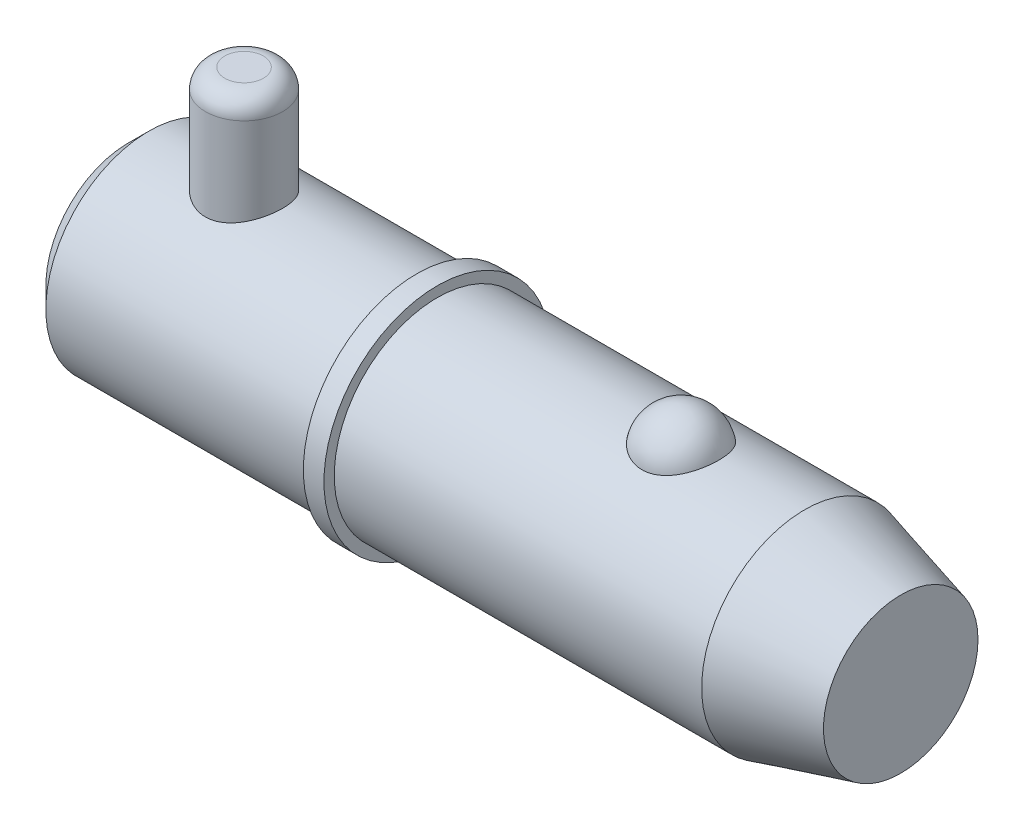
ISO-10303-21;
HEADER;
FILE_DESCRIPTION(('STEP AP214'),'2;1');
FILE_NAME('part.step','',(''),(''),'','','');
FILE_SCHEMA(('AUTOMOTIVE_DESIGN { 1 0 10303 214 1 1 1 1 }'));
ENDSEC;
DATA;
#1=APPLICATION_CONTEXT('core data for automotive mechanical design processes');
#2=APPLICATION_PROTOCOL_DEFINITION('international standard','automotive_design',2000,#1);
#3=PRODUCT_CONTEXT('',#1,'mechanical');
#4=PRODUCT('Part','Part','',(#3));
#5=PRODUCT_RELATED_PRODUCT_CATEGORY('part','',(#4));
#6=PRODUCT_DEFINITION_FORMATION('','',#4);
#7=PRODUCT_DEFINITION_CONTEXT('part definition',#1,'design');
#8=PRODUCT_DEFINITION('design','',#6,#7);
#9=PRODUCT_DEFINITION_SHAPE('','',#8);
#10=(LENGTH_UNIT() NAMED_UNIT(*) SI_UNIT(.MILLI.,.METRE.));
#11=(NAMED_UNIT(*) PLANE_ANGLE_UNIT() SI_UNIT($,.RADIAN.));
#12=(NAMED_UNIT(*) SI_UNIT($,.STERADIAN.) SOLID_ANGLE_UNIT());
#13=UNCERTAINTY_MEASURE_WITH_UNIT(LENGTH_MEASURE(1.E-05),#10,'distance_accuracy_value','');
#14=(GEOMETRIC_REPRESENTATION_CONTEXT(3) GLOBAL_UNCERTAINTY_ASSIGNED_CONTEXT((#13)) GLOBAL_UNIT_ASSIGNED_CONTEXT((#10,
#11,#12)) REPRESENTATION_CONTEXT('',''));
#15=CARTESIAN_POINT('',(0.,0.,0.));
#16=DIRECTION('',(0.,0.,1.));
#17=DIRECTION('',(1.,0.,0.));
#18=AXIS2_PLACEMENT_3D('',#15,#16,#17);
#19=CARTESIAN_POINT('',(14.28,25.4,0.));
#20=DIRECTION('',(0.,-1.,0.));
#21=DIRECTION('',(0.,0.,-1.));
#22=AXIS2_PLACEMENT_3D('',#19,#20,#21);
#23=CYLINDRICAL_SURFACE('',#22,4.76);
#24=CARTESIAN_POINT('',(14.28,-10.32,0.));
#25=DIRECTION('',(0.,1.,0.));
#26=DIRECTION('',(0.,0.,1.));
#27=AXIS2_PLACEMENT_3D('',#24,#25,#26);
#28=CIRCLE('',#27,4.76);
#29=CARTESIAN_POINT('',(14.28,-10.32,-4.76));
#30=VERTEX_POINT('',#29);
#31=EDGE_CURVE('P0_E25',#30,#30,#28,.T.);
#32=CARTESIAN_POINT('',(14.28,23.02,0.));
#33=DIRECTION('',(0.,1.,0.));
#34=DIRECTION('',(0.,0.,1.));
#35=AXIS2_PLACEMENT_3D('',#32,#33,#34);
#36=CIRCLE('',#35,4.76);
#37=CARTESIAN_POINT('',(14.28,23.02,-4.76));
#38=VERTEX_POINT('',#37);
#39=EDGE_CURVE('P0_E29',#38,#38,#36,.F.);
#40=CARTESIAN_POINT('',(14.28,-10.32,-4.76));
#41=CARTESIAN_POINT('',(14.28,-9.97270833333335,-4.76));
#42=CARTESIAN_POINT('',(14.28,-9.62541666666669,-4.76));
#43=CARTESIAN_POINT('',(14.28,-8.93083333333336,-4.76));
#44=CARTESIAN_POINT('',(14.28,-8.58354166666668,-4.76));
#45=CARTESIAN_POINT('',(14.28,-7.88895833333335,-4.76));
#46=CARTESIAN_POINT('',(14.28,-7.54166666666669,-4.76));
#47=CARTESIAN_POINT('',(14.28,-6.84708333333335,-4.76));
#48=CARTESIAN_POINT('',(14.28,-6.49979166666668,-4.76));
#49=CARTESIAN_POINT('',(14.28,-5.80520833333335,-4.76));
#50=CARTESIAN_POINT('',(14.28,-5.45791666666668,-4.76));
#51=CARTESIAN_POINT('',(14.28,-4.76333333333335,-4.76));
#52=CARTESIAN_POINT('',(14.28,-4.41604166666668,-4.76));
#53=CARTESIAN_POINT('',(14.28,-3.72145833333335,-4.76));
#54=CARTESIAN_POINT('',(14.28,-3.37416666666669,-4.76));
#55=CARTESIAN_POINT('',(14.28,-2.67958333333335,-4.76));
#56=CARTESIAN_POINT('',(14.28,-2.33229166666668,-4.76));
#57=CARTESIAN_POINT('',(14.28,-1.63770833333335,-4.76));
#58=CARTESIAN_POINT('',(14.28,-1.29041666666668,-4.76));
#59=CARTESIAN_POINT('',(14.28,-0.595833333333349,-4.76));
#60=CARTESIAN_POINT('',(14.28,-0.24854166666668,-4.76));
#61=CARTESIAN_POINT('',(14.28,0.446041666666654,-4.76));
#62=CARTESIAN_POINT('',(14.28,0.793333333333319,-4.76));
#63=CARTESIAN_POINT('',(14.28,1.48791666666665,-4.76));
#64=CARTESIAN_POINT('',(14.28,1.83520833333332,-4.76));
#65=CARTESIAN_POINT('',(14.28,2.52979166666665,-4.76));
#66=CARTESIAN_POINT('',(14.28,2.87708333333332,-4.76));
#67=CARTESIAN_POINT('',(14.28,3.57166666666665,-4.76));
#68=CARTESIAN_POINT('',(14.28,3.91895833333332,-4.76));
#69=CARTESIAN_POINT('',(14.28,4.61354166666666,-4.76));
#70=CARTESIAN_POINT('',(14.28,4.96083333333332,-4.76));
#71=CARTESIAN_POINT('',(14.28,5.65541666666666,-4.76));
#72=CARTESIAN_POINT('',(14.28,6.00270833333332,-4.76));
#73=CARTESIAN_POINT('',(14.28,6.69729166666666,-4.76));
#74=CARTESIAN_POINT('',(14.28,7.04458333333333,-4.76));
#75=CARTESIAN_POINT('',(14.28,7.73916666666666,-4.76));
#76=CARTESIAN_POINT('',(14.28,8.08645833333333,-4.76));
#77=CARTESIAN_POINT('',(14.28,8.78104166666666,-4.76));
#78=CARTESIAN_POINT('',(14.28,9.12833333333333,-4.76));
#79=CARTESIAN_POINT('',(14.28,9.82291666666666,-4.76));
#80=CARTESIAN_POINT('',(14.28,10.1702083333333,-4.76));
#81=CARTESIAN_POINT('',(14.28,10.8647916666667,-4.76));
#82=CARTESIAN_POINT('',(14.28,11.2120833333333,-4.76));
#83=CARTESIAN_POINT('',(14.28,11.9066666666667,-4.76));
#84=CARTESIAN_POINT('',(14.28,12.2539583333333,-4.76));
#85=CARTESIAN_POINT('',(14.28,12.9485416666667,-4.76));
#86=CARTESIAN_POINT('',(14.28,13.2958333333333,-4.76));
#87=CARTESIAN_POINT('',(14.28,13.9904166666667,-4.76));
#88=CARTESIAN_POINT('',(14.28,14.3377083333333,-4.76));
#89=CARTESIAN_POINT('',(14.28,15.0322916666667,-4.76));
#90=CARTESIAN_POINT('',(14.28,15.3795833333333,-4.76));
#91=CARTESIAN_POINT('',(14.28,16.0741666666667,-4.76));
#92=CARTESIAN_POINT('',(14.28,16.4214583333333,-4.76));
#93=CARTESIAN_POINT('',(14.28,17.1160416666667,-4.76));
#94=CARTESIAN_POINT('',(14.28,17.4633333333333,-4.76));
#95=CARTESIAN_POINT('',(14.28,18.1579166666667,-4.76));
#96=CARTESIAN_POINT('',(14.28,18.5052083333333,-4.76));
#97=CARTESIAN_POINT('',(14.28,19.1997916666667,-4.76));
#98=CARTESIAN_POINT('',(14.28,19.5470833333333,-4.76));
#99=CARTESIAN_POINT('',(14.28,20.2416666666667,-4.76));
#100=CARTESIAN_POINT('',(14.28,20.5889583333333,-4.76));
#101=CARTESIAN_POINT('',(14.28,21.2835416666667,-4.76));
#102=CARTESIAN_POINT('',(14.28,21.6308333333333,-4.76));
#103=CARTESIAN_POINT('',(14.28,22.3254166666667,-4.76));
#104=CARTESIAN_POINT('',(14.28,22.6727083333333,-4.76));
#105=CARTESIAN_POINT('',(14.28,23.02,-4.76));
#106=B_SPLINE_CURVE_WITH_KNOTS('',3,(#40,#41,#42,#43,#44,#45,#46,#47,#48,#49,#50,#51,#52,#53,
#54,#55,#56,#57,#58,#59,#60,#61,#62,#63,#64,#65,#66,#67,#68,#69,#70,#71,#72,#73,#74,#75,#76,#77,
#78,#79,#80,#81,#82,#83,#84,#85,#86,#87,#88,#89,#90,#91,#92,#93,#94,#95,#96,#97,#98,#99,#100,
#101,#102,#103,#104,#105),.UNSPECIFIED.,.F.,.F.,(4,2,2,2,2,2,2,2,2,2,2,2,2,2,2,2,2,2,2,2,2,2,2,
2,2,2,2,2,2,2,2,2,4),(0.,1.041875,2.08375,3.125625,4.1675,5.209375,6.25125,7.293125,
8.33500000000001,9.376875,10.41875,11.460625,12.5025,13.544375,14.58625,15.628125,16.67,
17.711875,18.75375,19.795625,20.8375,21.879375,22.92125,23.963125,25.005,26.046875,27.08875,
28.130625,29.1725,30.214375,31.25625,32.298125,33.34),.UNSPECIFIED.);
#107=EDGE_CURVE('P0_BSEAM14',#30,#38,#106,.T.);
#108=ORIENTED_EDGE('',*,*,#31,.T.);
#109=ORIENTED_EDGE('',*,*,#39,.T.);
#110=ORIENTED_EDGE('',*,*,#107,.T.);
#111=ORIENTED_EDGE('',*,*,#107,.F.);
#112=EDGE_LOOP('',(#108,#110,#109,#111));
#113=FACE_BOUND('',#112,.T.);
#114=ADVANCED_FACE('P0_F14',(#113),#23,.T.);
#115=CARTESIAN_POINT('',(14.28,25.4,0.));
#116=DIRECTION('',(0.,1.,0.));
#117=DIRECTION('',(0.,0.,1.));
#118=AXIS2_PLACEMENT_3D('',#115,#116,#117);
#119=PLANE('',#118);
#120=CARTESIAN_POINT('',(14.28,25.4,0.));
#121=DIRECTION('',(0.,1.,0.));
#122=DIRECTION('',(0.,0.,1.));
#123=AXIS2_PLACEMENT_3D('',#120,#121,#122);
#124=CIRCLE('',#123,2.38);
#125=CARTESIAN_POINT('',(14.28,25.4,2.38));
#126=VERTEX_POINT('',#125);
#127=EDGE_CURVE('P0_E10',#126,#126,#124,.T.);
#128=ORIENTED_EDGE('',*,*,#127,.T.);
#129=EDGE_LOOP('',(#128));
#130=FACE_BOUND('',#129,.T.);
#131=ADVANCED_FACE('P0_F46',(#130),#119,.T.);
#132=CARTESIAN_POINT('',(14.28,-12.7,0.));
#133=DIRECTION('',(0.,1.,0.));
#134=DIRECTION('',(0.,0.,1.));
#135=AXIS2_PLACEMENT_3D('',#132,#133,#134);
#136=PLANE('',#135);
#137=CARTESIAN_POINT('',(14.28,-12.7,0.));
#138=DIRECTION('',(0.,1.,0.));
#139=DIRECTION('',(0.,0.,1.));
#140=AXIS2_PLACEMENT_3D('',#137,#138,#139);
#141=CIRCLE('',#140,2.38);
#142=CARTESIAN_POINT('',(14.28,-12.7,2.38));
#143=VERTEX_POINT('',#142);
#144=EDGE_CURVE('P0_E21',#143,#143,#141,.F.);
#145=ORIENTED_EDGE('',*,*,#144,.T.);
#146=EDGE_LOOP('',(#145));
#147=FACE_BOUND('',#146,.T.);
#148=ADVANCED_FACE('P0_F43',(#147),#136,.F.);
#149=CARTESIAN_POINT('',(14.28,-10.32,0.));
#150=DIRECTION('',(0.,1.,0.));
#151=DIRECTION('',(0.,0.,1.));
#152=AXIS2_PLACEMENT_3D('',#149,#150,#151);
#153=DEGENERATE_TOROIDAL_SURFACE('',#152,2.38,2.38,.T.);
#154=ORIENTED_EDGE('',*,*,#144,.F.);
#155=EDGE_LOOP('',(#154));
#156=FACE_BOUND('',#155,.T.);
#157=ORIENTED_EDGE('',*,*,#31,.F.);
#158=EDGE_LOOP('',(#157));
#159=FACE_BOUND('',#158,.T.);
#160=ADVANCED_FACE('P0_F38',(#156,#159),#153,.T.);
#161=CARTESIAN_POINT('',(14.28,23.02,0.));
#162=DIRECTION('',(0.,1.,0.));
#163=DIRECTION('',(0.,0.,1.));
#164=AXIS2_PLACEMENT_3D('',#161,#162,#163);
#165=DEGENERATE_TOROIDAL_SURFACE('',#164,2.38,2.38,.T.);
#166=ORIENTED_EDGE('',*,*,#39,.F.);
#167=EDGE_LOOP('',(#166));
#168=FACE_BOUND('',#167,.T.);
#169=ORIENTED_EDGE('',*,*,#127,.F.);
#170=EDGE_LOOP('',(#169));
#171=FACE_BOUND('',#170,.T.);
#172=ADVANCED_FACE('P0_F16',(#168,#171),#165,.T.);
#173=CLOSED_SHELL('',(#114,#131,#148,#160,#172));
#174=MANIFOLD_SOLID_BREP('P0_B1',#173);
#175=CARTESIAN_POINT('',(0.,0.,0.));
#176=DIRECTION('',(1.,0.,0.));
#177=DIRECTION('',(0.,0.,-1.));
#178=AXIS2_PLACEMENT_3D('',#175,#176,#177);
#179=CYLINDRICAL_SURFACE('',#178,12.7);
#180=CARTESIAN_POINT('',(83.4007386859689,0.,0.));
#181=DIRECTION('',(1.,0.,0.));
#182=DIRECTION('',(0.,0.,-1.));
#183=AXIS2_PLACEMENT_3D('',#180,#181,#182);
#184=CIRCLE('',#183,12.7);
#185=CARTESIAN_POINT('',(83.4007386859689,0.,-12.7));
#186=VERTEX_POINT('',#185);
#187=EDGE_CURVE('P1_E81',#186,#186,#184,.T.);
#188=ORIENTED_EDGE('',*,*,#187,.F.);
#189=EDGE_LOOP('',(#188));
#190=FACE_BOUND('',#189,.T.);
#191=CARTESIAN_POINT('',(38.1,0.,0.));
#192=DIRECTION('',(1.,0.,0.));
#193=DIRECTION('',(0.,0.,-1.));
#194=AXIS2_PLACEMENT_3D('',#191,#192,#193);
#195=CIRCLE('',#194,12.7);
#196=CARTESIAN_POINT('',(38.1,0.,-12.7));
#197=VERTEX_POINT('',#196);
#198=EDGE_CURVE('P1_E85',#197,#197,#195,.T.);
#199=ORIENTED_EDGE('',*,*,#198,.T.);
#200=EDGE_LOOP('',(#199));
#201=FACE_BOUND('',#200,.T.);
#202=CARTESIAN_POINT('',(68.1600429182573,11.7500437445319,4.81938502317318));
#203=CARTESIAN_POINT('',(68.0350881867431,11.7500430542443,4.81938571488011));
#204=CARTESIAN_POINT('',(67.910144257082,11.7520975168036,4.81438658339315));
#205=CARTESIAN_POINT('',(67.6611425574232,11.760253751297,4.79442904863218));
#206=CARTESIAN_POINT('',(67.5370850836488,11.7663568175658,4.77946746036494));
#207=CARTESIAN_POINT('',(67.2909016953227,11.7824262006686,4.7397141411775));
#208=CARTESIAN_POINT('',(67.1687744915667,11.7923898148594,4.71492928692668));
#209=CARTESIAN_POINT('',(66.9271874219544,11.8158938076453,4.65571340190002));
#210=CARTESIAN_POINT('',(66.8077285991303,11.8294355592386,4.6212786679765));
#211=CARTESIAN_POINT('',(66.5725578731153,11.8596812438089,4.54309502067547));
#212=CARTESIAN_POINT('',(66.4568393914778,11.8763792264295,4.49936361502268));
#213=CARTESIAN_POINT('',(66.2296530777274,11.9124878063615,4.40287235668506));
#214=CARTESIAN_POINT('',(66.1181868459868,11.9318994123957,4.35010914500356));
#215=CARTESIAN_POINT('',(65.7912782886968,11.9934256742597,4.17881316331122));
#216=CARTESIAN_POINT('',(65.5831270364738,12.038858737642,4.04720756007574));
#217=CARTESIAN_POINT('',(65.1858509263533,12.1352173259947,3.748564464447));
#218=CARTESIAN_POINT('',(64.9974438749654,12.1862630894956,3.58061821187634));
#219=CARTESIAN_POINT('',(64.6505213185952,12.2875163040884,3.21600758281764));
#220=CARTESIAN_POINT('',(64.4920113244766,12.3377235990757,3.0193379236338));
#221=CARTESIAN_POINT('',(64.2016887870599,12.434492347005,2.592916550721));
#222=CARTESIAN_POINT('',(64.0713762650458,12.4807925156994,2.36208286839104));
#223=CARTESIAN_POINT('',(63.8494079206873,12.5623454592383,1.88070399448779));
#224=CARTESIAN_POINT('',(63.7577554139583,12.5975972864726,1.63015711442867));
#225=CARTESIAN_POINT('',(63.6140466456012,12.6538414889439,1.1129886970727));
#226=CARTESIAN_POINT('',(63.5624990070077,12.6746503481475,0.846205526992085));
#227=CARTESIAN_POINT('',(63.5019771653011,12.699153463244,0.307085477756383));
#228=CARTESIAN_POINT('',(63.4930018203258,12.7028481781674,0.0347487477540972));
#229=CARTESIAN_POINT('',(63.5177310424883,12.6927785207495,-0.506073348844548));
#230=CARTESIAN_POINT('',(63.5511899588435,12.6791146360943,-0.77457186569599));
#231=CARTESIAN_POINT('',(63.6596877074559,12.635882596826,-1.30170246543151));
#232=CARTESIAN_POINT('',(63.7347272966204,12.606314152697,-1.5603343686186));
#233=CARTESIAN_POINT('',(63.9250000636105,12.5342328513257,-2.06083899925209));
#234=CARTESIAN_POINT('',(64.0402872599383,12.4917026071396,-2.3026886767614));
#235=CARTESIAN_POINT('',(64.3087044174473,12.3981123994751,-2.76259600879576));
#236=CARTESIAN_POINT('',(64.4618374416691,12.3470517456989,-2.98065173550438));
#237=CARTESIAN_POINT('',(64.8035077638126,12.2416045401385,-3.38786328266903));
#238=CARTESIAN_POINT('',(64.9922017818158,12.1872040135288,-3.57688418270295));
#239=CARTESIAN_POINT('',(65.4002392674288,12.0814086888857,-3.91941073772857));
#240=CARTESIAN_POINT('',(65.6195800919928,12.0300136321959,-4.07291945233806));
#241=CARTESIAN_POINT('',(66.0783753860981,11.9373542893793,-4.33691289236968));
#242=CARTESIAN_POINT('',(66.3173044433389,11.8958982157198,-4.44824125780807));
#243=CARTESIAN_POINT('',(66.8124376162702,11.8268116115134,-4.62881985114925));
#244=CARTESIAN_POINT('',(67.0686351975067,11.7991758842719,-4.69808589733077));
#245=CARTESIAN_POINT('',(67.5771640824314,11.7622209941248,-4.78983181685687));
#246=CARTESIAN_POINT('',(67.8290414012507,11.7520502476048,-4.81449025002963));
#247=CARTESIAN_POINT('',(68.3335734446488,11.7485796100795,-4.82295735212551));
#248=CARTESIAN_POINT('',(68.5862280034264,11.7552763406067,-4.80677420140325));
#249=CARTESIAN_POINT('',(69.0768341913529,11.7842584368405,-4.73525430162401));
#250=CARTESIAN_POINT('',(69.3149984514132,11.8060486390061,-4.68116061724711));
#251=CARTESIAN_POINT('',(69.7784894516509,11.8622750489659,-4.53678133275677));
#252=CARTESIAN_POINT('',(70.0038151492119,11.8967122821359,-4.44649279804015));
#253=CARTESIAN_POINT('',(70.4408018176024,11.9754603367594,-4.2298761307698));
#254=CARTESIAN_POINT('',(70.6520579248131,12.0199699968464,-4.10280539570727));
#255=CARTESIAN_POINT('',(71.0506012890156,12.1138028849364,-3.81685409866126));
#256=CARTESIAN_POINT('',(71.2378830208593,12.163127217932,-3.65796622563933));
#257=CARTESIAN_POINT('',(71.5933509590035,12.2642343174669,-3.30364864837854));
#258=CARTESIAN_POINT('',(71.7601119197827,12.3160165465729,-3.10678783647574));
#259=CARTESIAN_POINT('',(72.0595799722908,12.4142566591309,-2.68748409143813));
#260=CARTESIAN_POINT('',(72.1922809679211,12.4607135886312,-2.46503658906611));
#261=CARTESIAN_POINT('',(72.4246912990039,12.5450236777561,-1.99289519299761));
#262=CARTESIAN_POINT('',(72.523215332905,12.5825557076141,-1.74255918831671));
#263=CARTESIAN_POINT('',(72.6792277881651,12.6431720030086,-1.22773734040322));
#264=CARTESIAN_POINT('',(72.7367157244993,12.6662560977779,-0.963251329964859));
#265=CARTESIAN_POINT('',(72.8095441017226,12.6956486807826,-0.427355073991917));
#266=CARTESIAN_POINT('',(72.8248378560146,12.7019385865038,-0.1559374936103));
#267=CARTESIAN_POINT('',(72.8127794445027,12.6970201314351,0.385928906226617));
#268=CARTESIAN_POINT('',(72.7854280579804,12.6858120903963,0.656377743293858));
#269=CARTESIAN_POINT('',(72.7130609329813,12.6568455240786,1.05454017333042));
#270=CARTESIAN_POINT('',(72.6837963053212,12.6451962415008,1.18577850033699));
#271=CARTESIAN_POINT('',(72.6150228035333,12.6181819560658,1.4451380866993));
#272=CARTESIAN_POINT('',(72.5755176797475,12.6028183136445,1.57326046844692));
#273=CARTESIAN_POINT('',(72.4864397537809,12.5687547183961,1.82554978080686));
#274=CARTESIAN_POINT('',(72.4368627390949,12.5500533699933,1.9497150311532));
#275=CARTESIAN_POINT('',(72.3279211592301,12.5098093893,2.1931437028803));
#276=CARTESIAN_POINT('',(72.2685601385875,12.4882677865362,2.31240887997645));
#277=CARTESIAN_POINT('',(72.1399712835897,12.4427679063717,2.54593031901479));
#278=CARTESIAN_POINT('',(72.0706888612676,12.4187964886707,2.66015396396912));
#279=CARTESIAN_POINT('',(71.922903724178,12.3691892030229,2.88202659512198));
#280=CARTESIAN_POINT('',(71.8444044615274,12.3435539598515,2.98967802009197));
#281=CARTESIAN_POINT('',(71.6785502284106,12.2912955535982,3.19774385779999));
#282=CARTESIAN_POINT('',(71.5911918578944,12.2646720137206,3.29815546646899));
#283=CARTESIAN_POINT('',(71.4081617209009,12.2111945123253,3.49095035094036));
#284=CARTESIAN_POINT('',(71.3124932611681,12.1843406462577,3.58333679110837));
#285=CARTESIAN_POINT('',(71.1136272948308,12.1312249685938,3.75922876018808));
#286=CARTESIAN_POINT('',(71.0104503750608,12.104961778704,3.84275713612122));
#287=CARTESIAN_POINT('',(70.7970133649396,12.0537284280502,4.00056406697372));
#288=CARTESIAN_POINT('',(70.6867562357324,12.028757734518,4.07484645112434));
#289=CARTESIAN_POINT('',(70.4597550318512,11.9808306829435,4.21367959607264));
#290=CARTESIAN_POINT('',(70.3430068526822,11.9578756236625,4.27822410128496));
#291=CARTESIAN_POINT('',(70.1039425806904,11.9147184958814,4.39698483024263));
#292=CARTESIAN_POINT('',(69.9816287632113,11.894515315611,4.45120522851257));
#293=CARTESIAN_POINT('',(69.722952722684,11.8561129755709,4.55255353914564));
#294=CARTESIAN_POINT('',(69.5862237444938,11.8381764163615,4.59884858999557));
#295=CARTESIAN_POINT('',(69.3086087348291,11.8069093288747,4.67853897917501));
#296=CARTESIAN_POINT('',(69.1677245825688,11.7935767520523,4.71194005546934));
#297=CARTESIAN_POINT('',(68.8830944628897,11.7720277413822,4.76552188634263));
#298=CARTESIAN_POINT('',(68.7393488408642,11.7638106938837,4.78570422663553));
#299=CARTESIAN_POINT('',(68.4504114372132,11.7528195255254,4.81263433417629));
#300=CARTESIAN_POINT('',(68.3052198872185,11.7500445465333,4.81938421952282));
#301=CARTESIAN_POINT('',(68.1600429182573,11.7500437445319,4.81938502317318));
#302=B_SPLINE_CURVE_WITH_KNOTS('',3,(#202,#203,#204,#205,#206,#207,#208,#209,#210,#211,#212,
#213,#214,#215,#216,#217,#218,#219,#220,#221,#222,#223,#224,#225,#226,#227,#228,#229,#230,#231,
#232,#233,#234,#235,#236,#237,#238,#239,#240,#241,#242,#243,#244,#245,#246,#247,#248,#249,#250,
#251,#252,#253,#254,#255,#256,#257,#258,#259,#260,#261,#262,#263,#264,#265,#266,#267,#268,#269,
#270,#271,#272,#273,#274,#275,#276,#277,#278,#279,#280,#281,#282,#283,#284,#285,#286,#287,#288,
#289,#290,#291,#292,#293,#294,#295,#296,#297,#298,#299,#300,#301),.UNSPECIFIED.,.T.,.F.,(4,2,2,
2,2,2,2,2,2,2,2,2,2,2,2,2,2,2,2,2,2,2,2,2,2,2,2,2,2,2,2,2,2,2,2,2,2,2,2,2,2,2,2,2,2,2,2,2,2,4),
(0.,0.374729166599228,0.749578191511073,1.12416526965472,1.49889629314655,1.87292776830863,
2.24709865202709,2.99481328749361,3.76399449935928,4.53331735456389,5.3368391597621,
6.14042986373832,6.95405296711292,7.76765424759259,8.57656703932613,9.38549455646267,
10.1955119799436,11.0055949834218,11.8193353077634,12.6330054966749,13.4294141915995,
14.2255231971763,14.9815786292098,15.7374826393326,16.4696948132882,17.2019663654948,
17.9501979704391,18.6986017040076,19.484470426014,20.2704797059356,21.0815215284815,
21.8925729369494,22.7045213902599,23.5164550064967,23.9209608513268,24.3253187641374,
24.7298461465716,25.1342272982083,25.54092555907,25.9474719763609,26.3541750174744,
26.7607169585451,27.1661834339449,27.5714814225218,27.9770386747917,28.3824315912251,
28.8181206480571,29.2536155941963,29.6890582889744,30.1244323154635),.UNSPECIFIED.);
#303=CARTESIAN_POINT('',(68.1600429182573,11.7500437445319,4.81938502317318));
#304=VERTEX_POINT('',#303);
#305=EDGE_CURVE('P1_E35',#304,#304,#302,.T.);
#306=ORIENTED_EDGE('',*,*,#305,.T.);
#307=EDGE_LOOP('',(#306));
#308=FACE_BOUND('',#307,.T.);
#309=ADVANCED_FACE('P1_F13',(#190,#201,#308),#179,.T.);
#310=CARTESIAN_POINT('',(0.,0.,0.));
#311=DIRECTION('',(-1.,0.,0.));
#312=DIRECTION('',(0.,0.,1.));
#313=AXIS2_PLACEMENT_3D('',#310,#311,#312);
#314=PLANE('',#313);
#315=CARTESIAN_POINT('',(0.,0.,0.));
#316=DIRECTION('',(1.,0.,0.));
#317=DIRECTION('',(0.,0.,-1.));
#318=AXIS2_PLACEMENT_3D('',#315,#316,#317);
#319=CIRCLE('',#318,10.16);
#320=CARTESIAN_POINT('',(0.,0.,-10.16));
#321=VERTEX_POINT('',#320);
#322=EDGE_CURVE('P1_E9',#321,#321,#319,.T.);
#323=ORIENTED_EDGE('',*,*,#322,.F.);
#324=EDGE_LOOP('',(#323));
#325=FACE_BOUND('',#324,.T.);
#326=ADVANCED_FACE('P1_F15',(#325),#314,.T.);
#327=CARTESIAN_POINT('',(2.53999999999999,0.,0.));
#328=DIRECTION('',(1.,0.,0.));
#329=DIRECTION('',(0.,0.,-1.));
#330=AXIS2_PLACEMENT_3D('',#327,#328,#329);
#331=CONICAL_SURFACE('',#330,12.7,0.78539816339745);
#332=ORIENTED_EDGE('',*,*,#322,.T.);
#333=EDGE_LOOP('',(#332));
#334=FACE_BOUND('',#333,.T.);
#335=CARTESIAN_POINT('',(2.53999999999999,0.,0.));
#336=DIRECTION('',(1.,0.,0.));
#337=DIRECTION('',(0.,0.,-1.));
#338=AXIS2_PLACEMENT_3D('',#335,#336,#337);
#339=CIRCLE('',#338,12.7);
#340=CARTESIAN_POINT('',(2.53999999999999,0.,-12.7));
#341=VERTEX_POINT('',#340);
#342=EDGE_CURVE('P1_E26',#341,#341,#339,.T.);
#343=ORIENTED_EDGE('',*,*,#342,.F.);
#344=EDGE_LOOP('',(#343));
#345=FACE_BOUND('',#344,.T.);
#346=ADVANCED_FACE('P1_F77',(#334,#345),#331,.T.);
#347=CARTESIAN_POINT('',(0.,0.,0.));
#348=DIRECTION('',(1.,0.,0.));
#349=DIRECTION('',(0.,0.,-1.));
#350=AXIS2_PLACEMENT_3D('',#347,#348,#349);
#351=CYLINDRICAL_SURFACE('',#350,12.7);
#352=CARTESIAN_POINT('',(14.28,-11.7742260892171,4.76));
#353=CARTESIAN_POINT('',(14.1514948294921,-11.7742255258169,4.76000061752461));
#354=CARTESIAN_POINT('',(14.0229980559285,-11.7763355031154,4.75479194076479));
#355=CARTESIAN_POINT('',(13.7669369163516,-11.7847043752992,4.73401198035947));
#356=CARTESIAN_POINT('',(13.6393728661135,-11.7909646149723,4.71843733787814));
#357=CARTESIAN_POINT('',(13.386226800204,-11.8074248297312,4.67709434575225));
#358=CARTESIAN_POINT('',(13.2606439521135,-11.8176231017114,4.65133040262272));
#359=CARTESIAN_POINT('',(13.0122434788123,-11.8416347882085,4.58985545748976));
#360=CARTESIAN_POINT('',(12.8894269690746,-11.8554496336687,4.55414051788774));
#361=CARTESIAN_POINT('',(12.6477622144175,-11.8862222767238,4.47320764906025));
#362=CARTESIAN_POINT('',(12.5289037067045,-11.9031710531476,4.4280169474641));
#363=CARTESIAN_POINT('',(12.2955059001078,-11.939736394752,4.32845291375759));
#364=CARTESIAN_POINT('',(12.1809682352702,-11.9593539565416,4.2740761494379));
#365=CARTESIAN_POINT('',(11.8448901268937,-12.0213893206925,4.09777237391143));
#366=CARTESIAN_POINT('',(11.6307077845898,-12.0670135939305,3.9626122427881));
#367=CARTESIAN_POINT('',(11.2179129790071,-12.1641514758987,3.65386230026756));
#368=CARTESIAN_POINT('',(11.0204399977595,-12.2158379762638,3.47881300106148));
#369=CARTESIAN_POINT('',(10.6568212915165,-12.3178468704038,3.09829182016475));
#370=CARTESIAN_POINT('',(10.4906822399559,-12.3681689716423,2.89281347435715));
#371=CARTESIAN_POINT('',(10.1890299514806,-12.4638367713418,2.44867909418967));
#372=CARTESIAN_POINT('',(10.054749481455,-12.5089552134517,2.20913281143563));
#373=CARTESIAN_POINT('',(9.82886079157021,-12.5870472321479,1.70885919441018));
#374=CARTESIAN_POINT('',(9.73723778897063,-12.620025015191,1.44813923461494));
#375=CARTESIAN_POINT('',(9.60324488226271,-12.6688874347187,0.9248423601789));
#376=CARTESIAN_POINT('',(9.55892269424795,-12.6854474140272,0.662829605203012));
#377=CARTESIAN_POINT('',(9.5145335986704,-12.7020320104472,0.134596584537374));
#378=CARTESIAN_POINT('',(9.5144523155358,-12.7020619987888,-0.131622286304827));
#379=CARTESIAN_POINT('',(9.55741019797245,-12.6860129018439,-0.646717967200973));
#380=CARTESIAN_POINT('',(9.59831845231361,-12.6707298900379,-0.895801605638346));
#381=CARTESIAN_POINT('',(9.71850987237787,-12.6268158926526,-1.38327219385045));
#382=CARTESIAN_POINT('',(9.79779575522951,-12.5981839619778,-1.62165838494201));
#383=CARTESIAN_POINT('',(9.99348296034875,-12.5298894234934,-2.08508424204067));
#384=CARTESIAN_POINT('',(10.110407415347,-12.4900724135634,-2.30987931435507));
#385=CARTESIAN_POINT('',(10.3775896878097,-12.4034373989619,-2.7372158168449));
#386=CARTESIAN_POINT('',(10.5278582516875,-12.3566171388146,-2.93975004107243));
#387=CARTESIAN_POINT('',(10.8677318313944,-12.257571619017,-3.32936830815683));
#388=CARTESIAN_POINT('',(11.0591227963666,-12.2051903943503,-3.51485714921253));
#389=CARTESIAN_POINT('',(11.4706087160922,-12.1031155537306,-3.85170663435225));
#390=CARTESIAN_POINT('',(11.6907108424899,-12.0534226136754,-4.00305872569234));
#391=CARTESIAN_POINT('',(12.1596597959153,-11.9613684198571,-4.27038218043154));
#392=CARTESIAN_POINT('',(12.4090353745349,-11.9191939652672,-4.38549550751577));
#393=CARTESIAN_POINT('',(12.9256290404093,-11.8491124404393,-4.57149117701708));
#394=CARTESIAN_POINT('',(13.1928371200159,-11.8211974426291,-4.64239810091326));
#395=CARTESIAN_POINT('',(13.7217488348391,-11.7846654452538,-4.73434137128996));
#396=CARTESIAN_POINT('',(13.9829438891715,-11.7750694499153,-4.75791141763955));
#397=CARTESIAN_POINT('',(14.5056760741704,-11.7734909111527,-4.76182097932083));
#398=CARTESIAN_POINT('',(14.7672131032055,-11.7815039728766,-4.74217128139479));
#399=CARTESIAN_POINT('',(15.2702140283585,-11.8132466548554,-4.66249544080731));
#400=CARTESIAN_POINT('',(15.5120417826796,-11.8362133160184,-4.60442726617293));
#401=CARTESIAN_POINT('',(15.9824097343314,-11.8943704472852,-4.45202868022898));
#402=CARTESIAN_POINT('',(16.2109472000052,-11.9295634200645,-4.35769084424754));
#403=CARTESIAN_POINT('',(16.6577741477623,-12.0098310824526,-4.13144368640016));
#404=CARTESIAN_POINT('',(16.8753590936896,-12.055226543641,-3.99825937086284));
#405=CARTESIAN_POINT('',(17.2859732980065,-12.150238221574,-3.69949845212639));
#406=CARTESIAN_POINT('',(17.4789935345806,-12.19985597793,-3.5339100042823));
#407=CARTESIAN_POINT('',(17.8477707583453,-12.3015434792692,-3.1624728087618));
#408=CARTESIAN_POINT('',(18.0216609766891,-12.3535695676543,-2.95473880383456));
#409=CARTESIAN_POINT('',(18.254545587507,-12.426745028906,-2.62277433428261));
#410=CARTESIAN_POINT('',(18.3275489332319,-12.4503382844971,-2.50865480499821));
#411=CARTESIAN_POINT('',(18.463723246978,-12.4952713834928,-2.27428971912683));
#412=CARTESIAN_POINT('',(18.5268984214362,-12.5166121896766,-2.15404681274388));
#413=CARTESIAN_POINT('',(18.6427140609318,-12.5563817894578,-1.90858448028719));
#414=CARTESIAN_POINT('',(18.6953855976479,-12.5748191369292,-1.78338108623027));
#415=CARTESIAN_POINT('',(18.7899337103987,-12.6083284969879,-1.52857834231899));
#416=CARTESIAN_POINT('',(18.8318147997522,-12.6234019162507,-1.39898085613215));
#417=CARTESIAN_POINT('',(18.9043819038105,-12.6497495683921,-1.13633254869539));
#418=CARTESIAN_POINT('',(18.9350698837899,-12.6610244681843,-1.00328233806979));
#419=CARTESIAN_POINT('',(18.9849303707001,-12.6794412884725,-0.734761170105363));
#420=CARTESIAN_POINT('',(19.0041035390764,-12.6865834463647,-0.59929035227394));
#421=CARTESIAN_POINT('',(19.0299427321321,-12.6962286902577,-0.335006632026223));
#422=CARTESIAN_POINT('',(19.0372742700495,-12.698978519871,-0.206267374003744));
#423=CARTESIAN_POINT('',(19.0414668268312,-12.7005496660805,0.0514515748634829));
#424=CARTESIAN_POINT('',(19.038324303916,-12.69936965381,0.180431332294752));
#425=CARTESIAN_POINT('',(19.0215965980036,-12.6931114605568,0.437551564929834));
#426=CARTESIAN_POINT('',(19.0080165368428,-12.6880351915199,0.565692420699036));
#427=CARTESIAN_POINT('',(18.9705519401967,-12.6741222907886,0.820297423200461));
#428=CARTESIAN_POINT('',(18.9466635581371,-12.665284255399,0.946760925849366));
#429=CARTESIAN_POINT('',(18.8895279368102,-12.6443449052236,1.19395899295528));
#430=CARTESIAN_POINT('',(18.8565273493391,-12.6323299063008,1.3147578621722));
#431=CARTESIAN_POINT('',(18.781239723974,-12.6052503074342,1.55308888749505));
#432=CARTESIAN_POINT('',(18.738949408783,-12.5901846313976,1.67061987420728));
#433=CARTESIAN_POINT('',(18.5986461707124,-12.5409473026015,2.01714406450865));
#434=CARTESIAN_POINT('',(18.4871532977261,-12.502717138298,2.24027279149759));
#435=CARTESIAN_POINT('',(18.2262440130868,-12.4173042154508,2.6742599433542));
#436=CARTESIAN_POINT('',(18.0754310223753,-12.3698127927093,2.88420891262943));
#437=CARTESIAN_POINT('',(17.7421836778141,-12.271667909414,3.27675114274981));
#438=CARTESIAN_POINT('',(17.5597380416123,-12.2210133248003,3.45933459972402));
#439=CARTESIAN_POINT('',(17.2605468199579,-12.1452079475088,3.7138066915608));
#440=CARTESIAN_POINT('',(17.1535518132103,-12.119328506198,3.79719993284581));
#441=CARTESIAN_POINT('',(16.9326449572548,-12.0688597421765,3.95467398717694));
#442=CARTESIAN_POINT('',(16.8187356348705,-12.0442699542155,4.02875817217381));
#443=CARTESIAN_POINT('',(16.5846234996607,-11.9971053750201,4.16711104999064));
#444=CARTESIAN_POINT('',(16.4644172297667,-11.9745317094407,4.23137427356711));
#445=CARTESIAN_POINT('',(16.2185866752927,-11.9321360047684,4.34949041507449));
#446=CARTESIAN_POINT('',(16.09296473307,-11.9123127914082,4.40334777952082));
#447=CARTESIAN_POINT('',(15.8314769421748,-11.875268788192,4.50232278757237));
#448=CARTESIAN_POINT('',(15.6954035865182,-11.8582009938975,4.54695127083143));
#449=CARTESIAN_POINT('',(15.4194002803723,-11.8284328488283,4.62383807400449));
#450=CARTESIAN_POINT('',(15.2794720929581,-11.815730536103,4.6561019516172));
#451=CARTESIAN_POINT('',(14.9969657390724,-11.7951940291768,4.70788444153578));
#452=CARTESIAN_POINT('',(14.8543884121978,-11.7873583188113,4.72740702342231));
#453=CARTESIAN_POINT('',(14.5678704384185,-11.7768749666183,4.75346370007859));
#454=CARTESIAN_POINT('',(14.4239299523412,-11.7742267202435,4.75999930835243));
#455=CARTESIAN_POINT('',(14.28,-11.7742260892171,4.76));
#456=B_SPLINE_CURVE_WITH_KNOTS('',3,(#352,#353,#354,#355,#356,#357,#358,#359,#360,#361,#362,
#363,#364,#365,#366,#367,#368,#369,#370,#371,#372,#373,#374,#375,#376,#377,#378,#379,#380,#381,
#382,#383,#384,#385,#386,#387,#388,#389,#390,#391,#392,#393,#394,#395,#396,#397,#398,#399,#400,
#401,#402,#403,#404,#405,#406,#407,#408,#409,#410,#411,#412,#413,#414,#415,#416,#417,#418,#419,
#420,#421,#422,#423,#424,#425,#426,#427,#428,#429,#430,#431,#432,#433,#434,#435,#436,#437,#438,
#439,#440,#441,#442,#443,#444,#445,#446,#447,#448,#449,#450,#451,#452,#453,#454,#455),
.UNSPECIFIED.,.T.,.F.,(4,2,2,2,2,2,2,2,2,2,2,2,2,2,2,2,2,2,2,2,2,2,2,2,2,2,2,2,2,2,2,2,2,2,2,2,
2,2,2,2,2,2,2,2,2,2,2,2,2,2,2,4),(0.,0.385378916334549,0.770882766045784,1.15622008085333,
1.54171009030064,1.92610725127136,2.31064835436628,3.07917291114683,3.88239385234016,
4.68578566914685,5.51648193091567,6.34689010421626,7.14151420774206,7.93588010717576,
8.69098665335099,9.44614666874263,10.2122918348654,10.9786842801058,11.789876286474,
12.6012713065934,13.4306405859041,14.2595482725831,15.0427613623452,15.8257790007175,
16.5716820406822,17.3177378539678,18.0917395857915,18.8660247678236,19.6893332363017,
20.1014571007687,20.5134040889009,20.9241137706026,21.3346513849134,21.7451168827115,
22.1555587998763,22.542011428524,22.928594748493,23.3149884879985,23.7015265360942,
24.0784835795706,24.4555738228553,25.2091300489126,25.994347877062,26.7798463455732,
27.1937428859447,27.6074890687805,28.0214648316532,28.4352633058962,28.8672794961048,
29.299101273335,29.7307884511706,30.1624253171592),.UNSPECIFIED.);
#457=CARTESIAN_POINT('',(14.28,-11.7742260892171,4.76));
#458=VERTEX_POINT('',#457);
#459=EDGE_CURVE('P1_E17',#458,#458,#456,.T.);
#460=ORIENTED_EDGE('',*,*,#459,.F.);
#461=EDGE_LOOP('',(#460));
#462=FACE_BOUND('',#461,.T.);
#463=CARTESIAN_POINT('',(14.28,11.7742260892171,4.76));
#464=CARTESIAN_POINT('',(14.4085051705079,11.7742255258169,4.76000061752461));
#465=CARTESIAN_POINT('',(14.5370019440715,11.7763355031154,4.75479194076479));
#466=CARTESIAN_POINT('',(14.7930630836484,11.7847043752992,4.73401198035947));
#467=CARTESIAN_POINT('',(14.9206271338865,11.7909646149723,4.71843733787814));
#468=CARTESIAN_POINT('',(15.173773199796,11.8074248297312,4.67709434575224));
#469=CARTESIAN_POINT('',(15.2993560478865,11.8176231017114,4.65133040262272));
#470=CARTESIAN_POINT('',(15.5477565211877,11.8416347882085,4.58985545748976));
#471=CARTESIAN_POINT('',(15.6705730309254,11.8554496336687,4.55414051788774));
#472=CARTESIAN_POINT('',(15.9122377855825,11.8862222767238,4.47320764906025));
#473=CARTESIAN_POINT('',(16.0310962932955,11.9031710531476,4.4280169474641));
#474=CARTESIAN_POINT('',(16.2644940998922,11.939736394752,4.32845291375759));
#475=CARTESIAN_POINT('',(16.3790317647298,11.9593539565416,4.2740761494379));
#476=CARTESIAN_POINT('',(16.7151098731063,12.0213893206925,4.09777237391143));
#477=CARTESIAN_POINT('',(16.9292922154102,12.0670135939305,3.96261224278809));
#478=CARTESIAN_POINT('',(17.3420870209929,12.1641514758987,3.65386230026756));
#479=CARTESIAN_POINT('',(17.5395600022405,12.2158379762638,3.47881300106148));
#480=CARTESIAN_POINT('',(17.9031787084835,12.3178468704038,3.09829182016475));
#481=CARTESIAN_POINT('',(18.0693177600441,12.3681689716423,2.89281347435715));
#482=CARTESIAN_POINT('',(18.3709700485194,12.4638367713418,2.44867909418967));
#483=CARTESIAN_POINT('',(18.505250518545,12.5089552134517,2.20913281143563));
#484=CARTESIAN_POINT('',(18.7311392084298,12.5870472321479,1.70885919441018));
#485=CARTESIAN_POINT('',(18.8227622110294,12.620025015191,1.44813923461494));
#486=CARTESIAN_POINT('',(18.9567551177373,12.6688874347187,0.924842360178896));
#487=CARTESIAN_POINT('',(19.0010773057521,12.6854474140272,0.662829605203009));
#488=CARTESIAN_POINT('',(19.0454664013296,12.7020320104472,0.134596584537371));
#489=CARTESIAN_POINT('',(19.0455476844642,12.7020619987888,-0.13162228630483));
#490=CARTESIAN_POINT('',(19.0025898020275,12.6860129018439,-0.646717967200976));
#491=CARTESIAN_POINT('',(18.9616815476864,12.6707298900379,-0.89580160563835));
#492=CARTESIAN_POINT('',(18.8414901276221,12.6268158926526,-1.38327219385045));
#493=CARTESIAN_POINT('',(18.7622042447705,12.5981839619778,-1.62165838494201));
#494=CARTESIAN_POINT('',(18.5665170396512,12.5298894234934,-2.08508424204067));
#495=CARTESIAN_POINT('',(18.449592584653,12.4900724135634,-2.30987931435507));
#496=CARTESIAN_POINT('',(18.1824103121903,12.4034373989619,-2.7372158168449));
#497=CARTESIAN_POINT('',(18.0321417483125,12.3566171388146,-2.93975004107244));
#498=CARTESIAN_POINT('',(17.6922681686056,12.257571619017,-3.32936830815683));
#499=CARTESIAN_POINT('',(17.5008772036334,12.2051903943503,-3.51485714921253));
#500=CARTESIAN_POINT('',(17.0893912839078,12.1031155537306,-3.85170663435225));
#501=CARTESIAN_POINT('',(16.8692891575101,12.0534226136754,-4.00305872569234));
#502=CARTESIAN_POINT('',(16.4003402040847,11.9613684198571,-4.27038218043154));
#503=CARTESIAN_POINT('',(16.1509646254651,11.9191939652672,-4.38549550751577));
#504=CARTESIAN_POINT('',(15.6343709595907,11.8491124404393,-4.57149117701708));
#505=CARTESIAN_POINT('',(15.367162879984,11.8211974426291,-4.64239810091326));
#506=CARTESIAN_POINT('',(14.8382511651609,11.7846654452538,-4.73434137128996));
#507=CARTESIAN_POINT('',(14.5770561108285,11.7750694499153,-4.75791141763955));
#508=CARTESIAN_POINT('',(14.0543239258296,11.7734909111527,-4.76182097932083));
#509=CARTESIAN_POINT('',(13.7927868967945,11.7815039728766,-4.74217128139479));
#510=CARTESIAN_POINT('',(13.2897859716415,11.8132466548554,-4.66249544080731));
#511=CARTESIAN_POINT('',(13.0479582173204,11.8362133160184,-4.60442726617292));
#512=CARTESIAN_POINT('',(12.5775902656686,11.8943704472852,-4.45202868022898));
#513=CARTESIAN_POINT('',(12.3490527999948,11.9295634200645,-4.35769084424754));
#514=CARTESIAN_POINT('',(11.9022258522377,12.0098310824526,-4.13144368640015));
#515=CARTESIAN_POINT('',(11.6846409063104,12.055226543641,-3.99825937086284));
#516=CARTESIAN_POINT('',(11.2740267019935,12.150238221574,-3.69949845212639));
#517=CARTESIAN_POINT('',(11.0810064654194,12.19985597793,-3.5339100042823));
#518=CARTESIAN_POINT('',(10.7122292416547,12.3015434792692,-3.1624728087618));
#519=CARTESIAN_POINT('',(10.5383390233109,12.3535695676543,-2.95473880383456));
#520=CARTESIAN_POINT('',(10.305454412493,12.426745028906,-2.6227743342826));
#521=CARTESIAN_POINT('',(10.2324510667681,12.4503382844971,-2.50865480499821));
#522=CARTESIAN_POINT('',(10.096276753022,12.4952713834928,-2.27428971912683));
#523=CARTESIAN_POINT('',(10.0331015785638,12.5166121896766,-2.15404681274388));
#524=CARTESIAN_POINT('',(9.91728593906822,12.5563817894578,-1.90858448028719));
#525=CARTESIAN_POINT('',(9.8646144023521,12.5748191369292,-1.78338108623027));
#526=CARTESIAN_POINT('',(9.77006628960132,12.6083284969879,-1.52857834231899));
#527=CARTESIAN_POINT('',(9.72818520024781,12.6234019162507,-1.39898085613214));
#528=CARTESIAN_POINT('',(9.65561809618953,12.6497495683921,-1.13633254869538));
#529=CARTESIAN_POINT('',(9.62493011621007,12.6610244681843,-1.00328233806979));
#530=CARTESIAN_POINT('',(9.57506962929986,12.6794412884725,-0.734761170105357));
#531=CARTESIAN_POINT('',(9.55589646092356,12.6865834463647,-0.599290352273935));
#532=CARTESIAN_POINT('',(9.53005726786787,12.6962286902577,-0.335006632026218));
#533=CARTESIAN_POINT('',(9.52272572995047,12.698978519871,-0.20626737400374));
#534=CARTESIAN_POINT('',(9.51853317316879,12.7005496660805,0.0514515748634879));
#535=CARTESIAN_POINT('',(9.52167569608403,12.69936965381,0.180431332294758));
#536=CARTESIAN_POINT('',(9.53840340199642,12.6931114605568,0.43755156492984));
#537=CARTESIAN_POINT('',(9.55198346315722,12.6880351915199,0.565692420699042));
#538=CARTESIAN_POINT('',(9.58944805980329,12.6741222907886,0.820297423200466));
#539=CARTESIAN_POINT('',(9.61333644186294,12.665284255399,0.946760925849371));
#540=CARTESIAN_POINT('',(9.67047206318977,12.6443449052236,1.19395899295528));
#541=CARTESIAN_POINT('',(9.7034726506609,12.6323299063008,1.31475786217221));
#542=CARTESIAN_POINT('',(9.77876027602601,12.6052503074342,1.55308888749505));
#543=CARTESIAN_POINT('',(9.82105059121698,12.5901846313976,1.67061987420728));
#544=CARTESIAN_POINT('',(9.96135382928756,12.5409473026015,2.01714406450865));
#545=CARTESIAN_POINT('',(10.0728467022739,12.502717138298,2.24027279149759));
#546=CARTESIAN_POINT('',(10.3337559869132,12.4173042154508,2.6742599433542));
#547=CARTESIAN_POINT('',(10.4845689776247,12.3698127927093,2.88420891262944));
#548=CARTESIAN_POINT('',(10.8178163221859,12.271667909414,3.27675114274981));
#549=CARTESIAN_POINT('',(11.0002619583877,12.2210133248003,3.45933459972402));
#550=CARTESIAN_POINT('',(11.2994531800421,12.1452079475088,3.7138066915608));
#551=CARTESIAN_POINT('',(11.4064481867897,12.119328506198,3.79719993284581));
#552=CARTESIAN_POINT('',(11.6273550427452,12.0688597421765,3.95467398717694));
#553=CARTESIAN_POINT('',(11.7412643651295,12.0442699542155,4.02875817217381));
#554=CARTESIAN_POINT('',(11.9753765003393,11.9971053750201,4.16711104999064));
#555=CARTESIAN_POINT('',(12.0955827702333,11.9745317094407,4.23137427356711));
#556=CARTESIAN_POINT('',(12.3414133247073,11.9321360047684,4.34949041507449));
#557=CARTESIAN_POINT('',(12.46703526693,11.9123127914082,4.40334777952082));
#558=CARTESIAN_POINT('',(12.7285230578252,11.875268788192,4.50232278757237));
#559=CARTESIAN_POINT('',(12.8645964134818,11.8582009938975,4.54695127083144));
#560=CARTESIAN_POINT('',(13.1405997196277,11.8284328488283,4.62383807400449));
#561=CARTESIAN_POINT('',(13.2805279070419,11.815730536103,4.6561019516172));
#562=CARTESIAN_POINT('',(13.5630342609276,11.7951940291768,4.70788444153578));
#563=CARTESIAN_POINT('',(13.7056115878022,11.7873583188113,4.72740702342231));
#564=CARTESIAN_POINT('',(13.9921295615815,11.7768749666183,4.75346370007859));
#565=CARTESIAN_POINT('',(14.1360700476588,11.7742267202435,4.75999930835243));
#566=CARTESIAN_POINT('',(14.28,11.7742260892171,4.76));
#567=B_SPLINE_CURVE_WITH_KNOTS('',3,(#463,#464,#465,#466,#467,#468,#469,#470,#471,#472,#473,
#474,#475,#476,#477,#478,#479,#480,#481,#482,#483,#484,#485,#486,#487,#488,#489,#490,#491,#492,
#493,#494,#495,#496,#497,#498,#499,#500,#501,#502,#503,#504,#505,#506,#507,#508,#509,#510,#511,
#512,#513,#514,#515,#516,#517,#518,#519,#520,#521,#522,#523,#524,#525,#526,#527,#528,#529,#530,
#531,#532,#533,#534,#535,#536,#537,#538,#539,#540,#541,#542,#543,#544,#545,#546,#547,#548,#549,
#550,#551,#552,#553,#554,#555,#556,#557,#558,#559,#560,#561,#562,#563,#564,#565,#566),
.UNSPECIFIED.,.T.,.F.,(4,2,2,2,2,2,2,2,2,2,2,2,2,2,2,2,2,2,2,2,2,2,2,2,2,2,2,2,2,2,2,2,2,2,2,2,
2,2,2,2,2,2,2,2,2,2,2,2,2,2,2,4),(0.,0.385378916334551,0.770882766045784,1.15622008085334,
1.54171009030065,1.92610725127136,2.31064835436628,3.07917291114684,3.88239385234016,
4.68578566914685,5.51648193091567,6.34689010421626,7.14151420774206,7.93588010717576,
8.690986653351,9.44614666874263,10.2122918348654,10.9786842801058,11.789876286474,
12.6012713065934,13.4306405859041,14.2595482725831,15.0427613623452,15.8257790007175,
16.5716820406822,17.3177378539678,18.0917395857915,18.8660247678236,19.6893332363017,
20.1014571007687,20.5134040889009,20.9241137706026,21.3346513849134,21.7451168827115,
22.1555587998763,22.542011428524,22.928594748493,23.3149884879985,23.7015265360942,
24.0784835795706,24.4555738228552,25.2091300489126,25.994347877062,26.7798463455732,
27.1937428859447,27.6074890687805,28.0214648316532,28.4352633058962,28.8672794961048,
29.299101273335,29.7307884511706,30.1624253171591),.UNSPECIFIED.);
#568=CARTESIAN_POINT('',(14.28,11.7742260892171,4.76));
#569=VERTEX_POINT('',#568);
#570=EDGE_CURVE('P1_E43',#569,#569,#567,.T.);
#571=ORIENTED_EDGE('',*,*,#570,.F.);
#572=EDGE_LOOP('',(#571));
#573=FACE_BOUND('',#572,.T.);
#574=ORIENTED_EDGE('',*,*,#342,.T.);
#575=EDGE_LOOP('',(#574));
#576=FACE_BOUND('',#575,.T.);
#577=CARTESIAN_POINT('',(35.56,0.,0.));
#578=DIRECTION('',(1.,0.,0.));
#579=DIRECTION('',(0.,0.,-1.));
#580=AXIS2_PLACEMENT_3D('',#577,#578,#579);
#581=CIRCLE('',#580,12.7);
#582=CARTESIAN_POINT('',(35.56,0.,-12.7));
#583=VERTEX_POINT('',#582);
#584=EDGE_CURVE('P1_E31',#583,#583,#581,.T.);
#585=ORIENTED_EDGE('',*,*,#584,.F.);
#586=EDGE_LOOP('',(#585));
#587=FACE_BOUND('',#586,.T.);
#588=ADVANCED_FACE('P1_F103',(#462,#573,#576,#587),#351,.T.);
#589=CARTESIAN_POINT('',(35.56,12.7,0.));
#590=DIRECTION('',(-1.,0.,0.));
#591=DIRECTION('',(0.,0.,1.));
#592=AXIS2_PLACEMENT_3D('',#589,#590,#591);
#593=PLANE('',#592);
#594=ORIENTED_EDGE('',*,*,#584,.T.);
#595=EDGE_LOOP('',(#594));
#596=FACE_BOUND('',#595,.T.);
#597=CARTESIAN_POINT('',(35.56,0.,0.));
#598=DIRECTION('',(1.,0.,0.));
#599=DIRECTION('',(0.,0.,-1.));
#600=AXIS2_PLACEMENT_3D('',#597,#598,#599);
#601=CIRCLE('',#600,13.97);
#602=CARTESIAN_POINT('',(35.56,0.,-13.97));
#603=VERTEX_POINT('',#602);
#604=EDGE_CURVE('P1_E91',#603,#603,#601,.T.);
#605=ORIENTED_EDGE('',*,*,#604,.F.);
#606=EDGE_LOOP('',(#605));
#607=FACE_BOUND('',#606,.T.);
#608=ADVANCED_FACE('P1_F100',(#596,#607),#593,.T.);
#609=CARTESIAN_POINT('',(0.,0.,0.));
#610=DIRECTION('',(1.,0.,0.));
#611=DIRECTION('',(0.,0.,-1.));
#612=AXIS2_PLACEMENT_3D('',#609,#610,#611);
#613=CYLINDRICAL_SURFACE('',#612,13.97);
#614=ORIENTED_EDGE('',*,*,#604,.T.);
#615=EDGE_LOOP('',(#614));
#616=FACE_BOUND('',#615,.T.);
#617=CARTESIAN_POINT('',(38.1,0.,0.));
#618=DIRECTION('',(1.,0.,0.));
#619=DIRECTION('',(0.,0.,-1.));
#620=AXIS2_PLACEMENT_3D('',#617,#618,#619);
#621=CIRCLE('',#620,13.97);
#622=CARTESIAN_POINT('',(38.1,0.,-13.97));
#623=VERTEX_POINT('',#622);
#624=EDGE_CURVE('P1_E88',#623,#623,#621,.T.);
#625=ORIENTED_EDGE('',*,*,#624,.F.);
#626=EDGE_LOOP('',(#625));
#627=FACE_BOUND('',#626,.T.);
#628=ADVANCED_FACE('P1_F68',(#616,#627),#613,.T.);
#629=CARTESIAN_POINT('',(38.1,13.97,0.));
#630=DIRECTION('',(1.,0.,0.));
#631=DIRECTION('',(0.,0.,-1.));
#632=AXIS2_PLACEMENT_3D('',#629,#630,#631);
#633=PLANE('',#632);
#634=ORIENTED_EDGE('',*,*,#624,.T.);
#635=EDGE_LOOP('',(#634));
#636=FACE_BOUND('',#635,.T.);
#637=ORIENTED_EDGE('',*,*,#198,.F.);
#638=EDGE_LOOP('',(#637));
#639=FACE_BOUND('',#638,.T.);
#640=ADVANCED_FACE('P1_F62',(#636,#639),#633,.T.);
#641=CARTESIAN_POINT('',(95.25,0.,0.));
#642=DIRECTION('',(-1.,0.,0.));
#643=DIRECTION('',(0.,0.,1.));
#644=AXIS2_PLACEMENT_3D('',#641,#642,#643);
#645=CONICAL_SURFACE('',#644,9.52500000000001,0.26179938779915);
#646=ORIENTED_EDGE('',*,*,#187,.T.);
#647=EDGE_LOOP('',(#646));
#648=FACE_BOUND('',#647,.T.);
#649=CARTESIAN_POINT('',(95.25,0.,0.));
#650=DIRECTION('',(1.,0.,0.));
#651=DIRECTION('',(0.,0.,-1.));
#652=AXIS2_PLACEMENT_3D('',#649,#650,#651);
#653=CIRCLE('',#652,9.52500000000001);
#654=CARTESIAN_POINT('',(95.25,0.,-9.52500000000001));
#655=VERTEX_POINT('',#654);
#656=EDGE_CURVE('P1_E42',#655,#655,#653,.T.);
#657=ORIENTED_EDGE('',*,*,#656,.F.);
#658=EDGE_LOOP('',(#657));
#659=FACE_BOUND('',#658,.T.);
#660=ADVANCED_FACE('P1_F59',(#648,#659),#645,.T.);
#661=CARTESIAN_POINT('',(95.25,9.52500000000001,0.));
#662=DIRECTION('',(1.,0.,0.));
#663=DIRECTION('',(0.,0.,-1.));
#664=AXIS2_PLACEMENT_3D('',#661,#662,#663);
#665=PLANE('',#664);
#666=ORIENTED_EDGE('',*,*,#656,.T.);
#667=EDGE_LOOP('',(#666));
#668=FACE_BOUND('',#667,.T.);
#669=ADVANCED_FACE('P1_F55',(#668),#665,.T.);
#670=CARTESIAN_POINT('',(68.1600429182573,11.43,0.));
#671=DIRECTION('',(-1.,0.,0.));
#672=DIRECTION('',(0.,1.,0.));
#673=AXIS2_PLACEMENT_3D('',#670,#671,#672);
#674=SPHERICAL_SURFACE('',#673,4.83);
#675=ORIENTED_EDGE('',*,*,#305,.F.);
#676=EDGE_LOOP('',(#675));
#677=FACE_BOUND('',#676,.T.);
#678=ADVANCED_FACE('P1_F50',(#677),#674,.T.);
#679=CARTESIAN_POINT('',(14.28,-13.97,0.));
#680=DIRECTION('',(0.,1.,0.));
#681=DIRECTION('',(0.,0.,1.));
#682=AXIS2_PLACEMENT_3D('',#679,#680,#681);
#683=CYLINDRICAL_SURFACE('',#682,4.76);
#684=ORIENTED_EDGE('',*,*,#459,.T.);
#685=EDGE_LOOP('',(#684));
#686=FACE_BOUND('',#685,.T.);
#687=ORIENTED_EDGE('',*,*,#570,.T.);
#688=EDGE_LOOP('',(#687));
#689=FACE_BOUND('',#688,.T.);
#690=ADVANCED_FACE('P1_F54',(#686,#689),#683,.F.);
#691=CLOSED_SHELL('',(#309,#326,#346,#588,#608,#628,#640,#660,#669,#678,#690));
#692=MANIFOLD_SOLID_BREP('P1_B1',#691);
#693=ADVANCED_BREP_SHAPE_REPRESENTATION('',(#18,#174,#692),#14);
#694=SHAPE_DEFINITION_REPRESENTATION(#9,#693);
ENDSEC;
END-ISO-10303-21;
